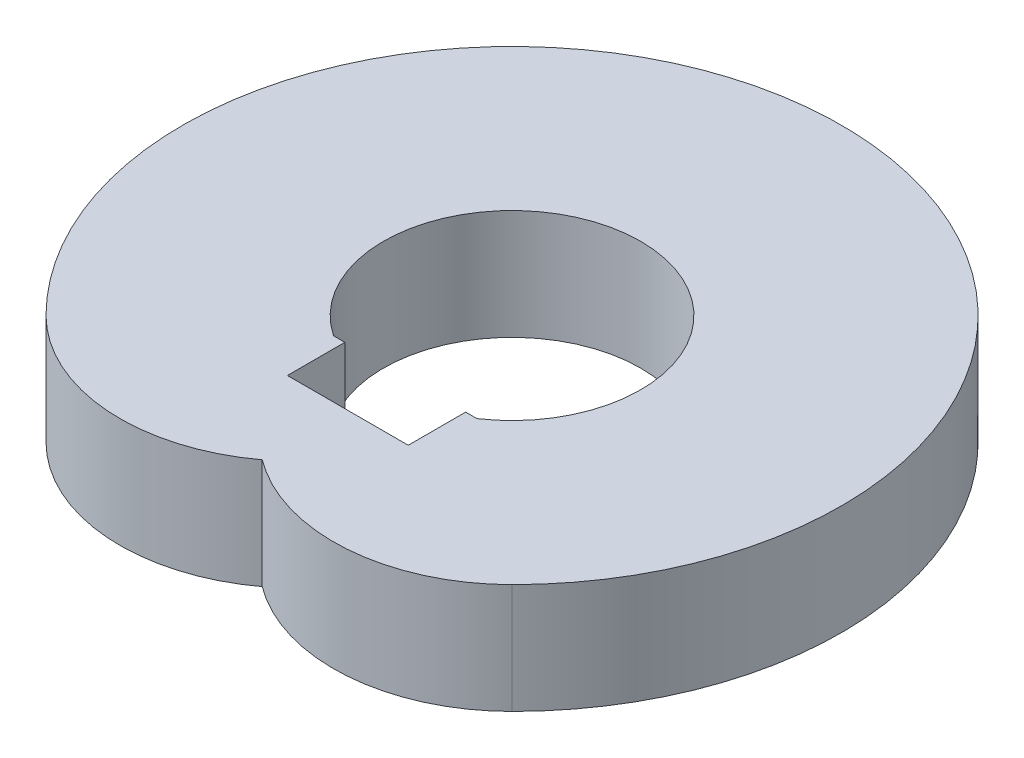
from build123d import *

# Parameters (mm, degrees)
EXTRUDE_1_DEPTH = 200


with BuildPart() as part:
    # Sketch 1 → Extrude 1 (new body)
    with BuildSketch(Plane(origin=(0, 0, 0), x_dir=(1, 0, 0), z_dir=(0, 1, 0))):
        with BuildLine():
            ThreePointArc((424.264068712, -424.264068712), (0, 600), (-424.264068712, -424.264068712))
            ThreePointArc((-424.264068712, -424.264068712), (-217.833180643, -518.612398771), (0, -454.862698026))
            ThreePointArc((0, -454.862698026), (217.833180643, -518.612398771), (424.264068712, -424.264068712))
        make_face()
        with BuildLine():
            Line((-110, -194.454364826), (-110, -299))
            Line((-110, -299), (110, -299))
            Line((110, -299), (110, -194.454364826))
            Line((110, -194.454364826), (130.545635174, -194.454364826))
            ThreePointArc((130.545635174, -194.454364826), (0, 234.210723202), (-130.545635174, -194.454364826))
            Line((-130.545635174, -194.454364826), (-110, -194.454364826))
        make_face(mode=Mode.SUBTRACT)
    extrude(amount=EXTRUDE_1_DEPTH)


solid = part.part
